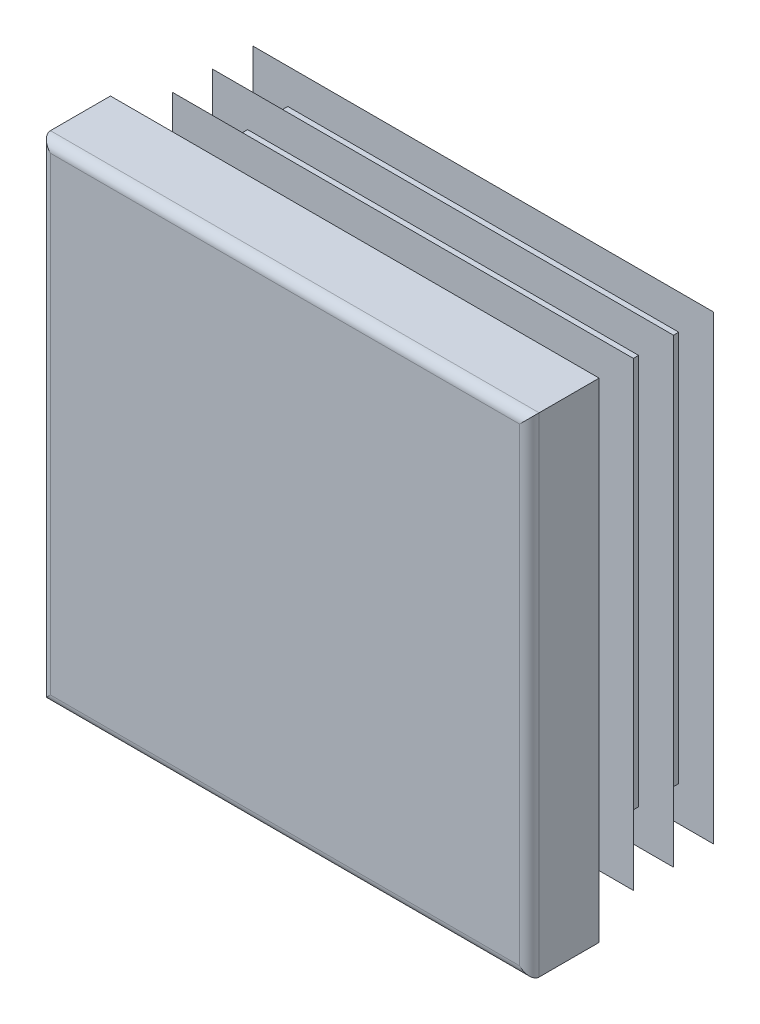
ISO-10303-21;
HEADER;
FILE_DESCRIPTION(('STEP AP214'),'2;1');
FILE_NAME('part.step','',(''),(''),'','','');
FILE_SCHEMA(('AUTOMOTIVE_DESIGN { 1 0 10303 214 1 1 1 1 }'));
ENDSEC;
DATA;
#1=APPLICATION_CONTEXT('core data for automotive mechanical design processes');
#2=APPLICATION_PROTOCOL_DEFINITION('international standard','automotive_design',2000,#1);
#3=PRODUCT_CONTEXT('',#1,'mechanical');
#4=PRODUCT('Part','Part','',(#3));
#5=PRODUCT_RELATED_PRODUCT_CATEGORY('part','',(#4));
#6=PRODUCT_DEFINITION_FORMATION('','',#4);
#7=PRODUCT_DEFINITION_CONTEXT('part definition',#1,'design');
#8=PRODUCT_DEFINITION('design','',#6,#7);
#9=PRODUCT_DEFINITION_SHAPE('','',#8);
#10=(LENGTH_UNIT() NAMED_UNIT(*) SI_UNIT(.MILLI.,.METRE.));
#11=(NAMED_UNIT(*) PLANE_ANGLE_UNIT() SI_UNIT($,.RADIAN.));
#12=(NAMED_UNIT(*) SI_UNIT($,.STERADIAN.) SOLID_ANGLE_UNIT());
#13=UNCERTAINTY_MEASURE_WITH_UNIT(LENGTH_MEASURE(1.E-05),#10,'distance_accuracy_value','');
#14=(GEOMETRIC_REPRESENTATION_CONTEXT(3) GLOBAL_UNCERTAINTY_ASSIGNED_CONTEXT((#13)) GLOBAL_UNIT_ASSIGNED_CONTEXT((#10,
#11,#12)) REPRESENTATION_CONTEXT('',''));
#15=CARTESIAN_POINT('',(0.,0.,0.));
#16=DIRECTION('',(0.,0.,1.));
#17=DIRECTION('',(1.,0.,0.));
#18=AXIS2_PLACEMENT_3D('',#15,#16,#17);
#19=CARTESIAN_POINT('',(16.8,-17.5,5.));
#20=DIRECTION('',(0.,0.,-1.));
#21=DIRECTION('',(0.,1.,0.));
#22=AXIS2_PLACEMENT_3D('',#19,#20,#21);
#23=PLANE('',#22);
#24=DIRECTION('',(0.,1.,0.));
#25=VECTOR('',#24,1.);
#26=CARTESIAN_POINT('',(-16.8,-17.5,5.));
#27=LINE('',#26,#25);
#28=CARTESIAN_POINT('',(-16.8,-16.8,5.));
#29=VERTEX_POINT('',#28);
#30=CARTESIAN_POINT('',(-16.8,16.8,5.));
#31=VERTEX_POINT('',#30);
#32=EDGE_CURVE('E262',#29,#31,#27,.T.);
#33=ORIENTED_EDGE('',*,*,#32,.F.);
#34=DIRECTION('',(-1.,0.,0.));
#35=VECTOR('',#34,1.);
#36=CARTESIAN_POINT('',(17.5,-16.8,5.));
#37=LINE('',#36,#35);
#38=CARTESIAN_POINT('',(16.8,-16.8,5.));
#39=VERTEX_POINT('',#38);
#40=EDGE_CURVE('E432',#39,#29,#37,.T.);
#41=ORIENTED_EDGE('',*,*,#40,.F.);
#42=DIRECTION('',(0.,1.,0.));
#43=VECTOR('',#42,1.);
#44=CARTESIAN_POINT('',(16.8,-17.5,5.));
#45=LINE('',#44,#43);
#46=CARTESIAN_POINT('',(16.8,16.8,5.));
#47=VERTEX_POINT('',#46);
#48=EDGE_CURVE('E257',#39,#47,#45,.T.);
#49=ORIENTED_EDGE('',*,*,#48,.T.);
#50=DIRECTION('',(-1.,0.,0.));
#51=VECTOR('',#50,1.);
#52=CARTESIAN_POINT('',(17.5,16.8,5.));
#53=LINE('',#52,#51);
#54=EDGE_CURVE('E534',#47,#31,#53,.T.);
#55=ORIENTED_EDGE('',*,*,#54,.T.);
#56=EDGE_LOOP('',(#33,#41,#49,#55));
#57=FACE_BOUND('',#56,.T.);
#58=ADVANCED_FACE('F14',(#57),#23,.F.);
#59=CARTESIAN_POINT('',(-16.8,-17.5,4.3));
#60=DIRECTION('',(0.,1.,0.));
#61=DIRECTION('',(-1.,0.,0.));
#62=AXIS2_PLACEMENT_3D('',#59,#60,#61);
#63=CYLINDRICAL_SURFACE('',#62,0.7);
#64=DIRECTION('',(0.,1.,0.));
#65=VECTOR('',#64,1.);
#66=CARTESIAN_POINT('',(-17.5,-17.5,4.3));
#67=LINE('',#66,#65);
#68=CARTESIAN_POINT('',(-17.5,-17.5,4.3));
#69=VERTEX_POINT('',#68);
#70=CARTESIAN_POINT('',(-17.5,17.5,4.3));
#71=VERTEX_POINT('',#70);
#72=EDGE_CURVE('E354',#69,#71,#67,.T.);
#73=ORIENTED_EDGE('',*,*,#72,.F.);
#74=CARTESIAN_POINT('',(-16.8,-16.8,4.3));
#75=DIRECTION('',(-0.707106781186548,0.707106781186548,0.));
#76=DIRECTION('',(0.707106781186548,0.707106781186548,0.));
#77=AXIS2_PLACEMENT_3D('',#74,#75,#76);
#78=ELLIPSE('',#77,0.989949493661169,0.7);
#79=EDGE_CURVE('E59',#69,#29,#78,.T.);
#80=ORIENTED_EDGE('',*,*,#79,.T.);
#81=ORIENTED_EDGE('',*,*,#32,.T.);
#82=CARTESIAN_POINT('',(-16.8,16.8,4.3));
#83=DIRECTION('',(0.707106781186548,0.707106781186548,0.));
#84=DIRECTION('',(-0.707106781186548,0.707106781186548,0.));
#85=AXIS2_PLACEMENT_3D('',#82,#83,#84);
#86=ELLIPSE('',#85,0.989949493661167,0.7);
#87=EDGE_CURVE('E258',#31,#71,#86,.F.);
#88=ORIENTED_EDGE('',*,*,#87,.T.);
#89=EDGE_LOOP('',(#73,#80,#81,#88));
#90=FACE_BOUND('',#89,.T.);
#91=ADVANCED_FACE('F16',(#90),#63,.T.);
#92=CARTESIAN_POINT('',(-17.5,-17.5,4.3));
#93=DIRECTION('',(1.,0.,0.));
#94=DIRECTION('',(0.,1.,0.));
#95=AXIS2_PLACEMENT_3D('',#92,#93,#94);
#96=PLANE('',#95);
#97=DIRECTION('',(0.,0.,-1.));
#98=VECTOR('',#97,1.);
#99=CARTESIAN_POINT('',(-17.5,17.5,4.3));
#100=LINE('',#99,#98);
#101=CARTESIAN_POINT('',(-17.5,17.5,0.));
#102=VERTEX_POINT('',#101);
#103=EDGE_CURVE('E519',#71,#102,#100,.T.);
#104=ORIENTED_EDGE('',*,*,#103,.T.);
#105=DIRECTION('',(0.,1.,0.));
#106=VECTOR('',#105,1.);
#107=CARTESIAN_POINT('',(-17.5,-17.5,0.));
#108=LINE('',#107,#106);
#109=CARTESIAN_POINT('',(-17.5,-17.5,0.));
#110=VERTEX_POINT('',#109);
#111=EDGE_CURVE('E352',#110,#102,#108,.T.);
#112=ORIENTED_EDGE('',*,*,#111,.F.);
#113=DIRECTION('',(0.,0.,-1.));
#114=VECTOR('',#113,1.);
#115=CARTESIAN_POINT('',(-17.5,-17.5,4.3));
#116=LINE('',#115,#114);
#117=EDGE_CURVE('E520',#69,#110,#116,.T.);
#118=ORIENTED_EDGE('',*,*,#117,.F.);
#119=ORIENTED_EDGE('',*,*,#72,.T.);
#120=EDGE_LOOP('',(#104,#112,#118,#119));
#121=FACE_BOUND('',#120,.T.);
#122=ADVANCED_FACE('F604',(#121),#96,.F.);
#123=CARTESIAN_POINT('',(-14.,-17.5,0.));
#124=DIRECTION('',(1.,0.,0.));
#125=DIRECTION('',(0.,1.,0.));
#126=AXIS2_PLACEMENT_3D('',#123,#124,#125);
#127=PLANE('',#126);
#128=DIRECTION('',(0.,1.,0.));
#129=VECTOR('',#128,1.);
#130=CARTESIAN_POINT('',(-14.,-17.5,0.));
#131=LINE('',#130,#129);
#132=CARTESIAN_POINT('',(-14.,-14.,0.));
#133=VERTEX_POINT('',#132);
#134=CARTESIAN_POINT('',(-14.,14.,0.));
#135=VERTEX_POINT('',#134);
#136=EDGE_CURVE('E349',#133,#135,#131,.T.);
#137=ORIENTED_EDGE('',*,*,#136,.T.);
#138=DIRECTION('',(0.,0.,-1.));
#139=VECTOR('',#138,1.);
#140=CARTESIAN_POINT('',(-14.,14.,0.));
#141=LINE('',#140,#139);
#142=CARTESIAN_POINT('',(-14.,14.,-0.575));
#143=VERTEX_POINT('',#142);
#144=EDGE_CURVE('E445',#135,#143,#141,.T.);
#145=ORIENTED_EDGE('',*,*,#144,.T.);
#146=DIRECTION('',(0.,1.,0.));
#147=VECTOR('',#146,1.);
#148=CARTESIAN_POINT('',(-14.,-17.5,-0.575));
#149=LINE('',#148,#147);
#150=CARTESIAN_POINT('',(-14.,-14.,-0.575));
#151=VERTEX_POINT('',#150);
#152=EDGE_CURVE('E346',#151,#143,#149,.T.);
#153=ORIENTED_EDGE('',*,*,#152,.F.);
#154=DIRECTION('',(0.,0.,1.));
#155=VECTOR('',#154,1.);
#156=CARTESIAN_POINT('',(-14.,-14.,0.));
#157=LINE('',#156,#155);
#158=EDGE_CURVE('E439',#151,#133,#157,.T.);
#159=ORIENTED_EDGE('',*,*,#158,.T.);
#160=EDGE_LOOP('',(#137,#145,#153,#159));
#161=FACE_BOUND('',#160,.T.);
#162=ADVANCED_FACE('F728',(#161),#127,.F.);
#163=CARTESIAN_POINT('',(-16.5,-17.5,-0.575));
#164=DIRECTION('',(0.573576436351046,0.,0.819152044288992));
#165=DIRECTION('',(-0.819152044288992,0.,0.573576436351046));
#166=AXIS2_PLACEMENT_3D('',#163,#164,#165);
#167=PLANE('',#166);
#168=DIRECTION('',(0.,1.,0.));
#169=VECTOR('',#168,1.);
#170=CARTESIAN_POINT('',(-16.5,-17.5,-0.575));
#171=LINE('',#170,#169);
#172=CARTESIAN_POINT('',(-16.5,-16.5,-0.575));
#173=VERTEX_POINT('',#172);
#174=CARTESIAN_POINT('',(-16.5,16.5,-0.575));
#175=VERTEX_POINT('',#174);
#176=EDGE_CURVE('E344',#173,#175,#171,.T.);
#177=ORIENTED_EDGE('',*,*,#176,.T.);
#178=DIRECTION('',(0.633687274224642,-0.633687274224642,-0.443712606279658));
#179=VECTOR('',#178,1.);
#180=CARTESIAN_POINT('',(-2.84697490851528,2.84697490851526,-10.1349510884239));
#181=LINE('',#180,#179);
#182=CARTESIAN_POINT('',(-14.,14.,-2.32551884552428));
#183=VERTEX_POINT('',#182);
#184=EDGE_CURVE('E457',#175,#183,#181,.T.);
#185=ORIENTED_EDGE('',*,*,#184,.T.);
#186=DIRECTION('',(0.,1.,0.));
#187=VECTOR('',#186,1.);
#188=CARTESIAN_POINT('',(-14.,-17.5,-2.32551884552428));
#189=LINE('',#188,#187);
#190=CARTESIAN_POINT('',(-14.,-14.,-2.32551884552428));
#191=VERTEX_POINT('',#190);
#192=EDGE_CURVE('E341',#191,#183,#189,.T.);
#193=ORIENTED_EDGE('',*,*,#192,.F.);
#194=DIRECTION('',(-0.633687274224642,-0.633687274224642,0.443712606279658));
#195=VECTOR('',#194,1.);
#196=CARTESIAN_POINT('',(-16.9015595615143,-16.9015595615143,-0.293824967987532));
#197=LINE('',#196,#195);
#198=EDGE_CURVE('E451',#191,#173,#197,.T.);
#199=ORIENTED_EDGE('',*,*,#198,.T.);
#200=EDGE_LOOP('',(#177,#185,#193,#199));
#201=FACE_BOUND('',#200,.T.);
#202=ADVANCED_FACE('F732',(#201),#167,.F.);
#203=CARTESIAN_POINT('',(-14.,-17.5,-2.32551884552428));
#204=DIRECTION('',(1.,0.,0.));
#205=DIRECTION('',(0.,1.,0.));
#206=AXIS2_PLACEMENT_3D('',#203,#204,#205);
#207=PLANE('',#206);
#208=ORIENTED_EDGE('',*,*,#192,.T.);
#209=DIRECTION('',(0.,0.,-1.));
#210=VECTOR('',#209,1.);
#211=CARTESIAN_POINT('',(-14.,14.,-2.32551884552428));
#212=LINE('',#211,#210);
#213=CARTESIAN_POINT('',(-14.,14.,-3.45));
#214=VERTEX_POINT('',#213);
#215=EDGE_CURVE('E463',#183,#214,#212,.T.);
#216=ORIENTED_EDGE('',*,*,#215,.T.);
#217=DIRECTION('',(0.,1.,0.));
#218=VECTOR('',#217,1.);
#219=CARTESIAN_POINT('',(-14.,-17.5,-3.45));
#220=LINE('',#219,#218);
#221=CARTESIAN_POINT('',(-14.,-14.,-3.45));
#222=VERTEX_POINT('',#221);
#223=EDGE_CURVE('E338',#222,#214,#220,.T.);
#224=ORIENTED_EDGE('',*,*,#223,.F.);
#225=DIRECTION('',(0.,0.,1.));
#226=VECTOR('',#225,1.);
#227=CARTESIAN_POINT('',(-14.,-14.,-2.32551884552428));
#228=LINE('',#227,#226);
#229=EDGE_CURVE('E460',#222,#191,#228,.T.);
#230=ORIENTED_EDGE('',*,*,#229,.T.);
#231=EDGE_LOOP('',(#208,#216,#224,#230));
#232=FACE_BOUND('',#231,.T.);
#233=ADVANCED_FACE('F738',(#232),#207,.F.);
#234=CARTESIAN_POINT('',(-16.5,-17.5,-3.45));
#235=DIRECTION('',(0.573576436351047,0.,0.819152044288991));
#236=DIRECTION('',(-0.819152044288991,0.,0.573576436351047));
#237=AXIS2_PLACEMENT_3D('',#234,#235,#236);
#238=PLANE('',#237);
#239=DIRECTION('',(0.,1.,0.));
#240=VECTOR('',#239,1.);
#241=CARTESIAN_POINT('',(-16.5,-17.5,-3.45));
#242=LINE('',#241,#240);
#243=CARTESIAN_POINT('',(-16.5,-16.5,-3.45));
#244=VERTEX_POINT('',#243);
#245=CARTESIAN_POINT('',(-16.5,16.5,-3.45));
#246=VERTEX_POINT('',#245);
#247=EDGE_CURVE('E336',#244,#246,#242,.T.);
#248=ORIENTED_EDGE('',*,*,#247,.T.);
#249=DIRECTION('',(0.633687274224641,-0.633687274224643,-0.443712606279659));
#250=VECTOR('',#249,1.);
#251=CARTESIAN_POINT('',(-2.84697490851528,2.84697490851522,-13.0099510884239));
#252=LINE('',#251,#250);
#253=CARTESIAN_POINT('',(-14.,14.,-5.20051884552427));
#254=VERTEX_POINT('',#253);
#255=EDGE_CURVE('E475',#246,#254,#252,.T.);
#256=ORIENTED_EDGE('',*,*,#255,.T.);
#257=DIRECTION('',(0.,1.,0.));
#258=VECTOR('',#257,1.);
#259=CARTESIAN_POINT('',(-14.,-17.5,-5.20051884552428));
#260=LINE('',#259,#258);
#261=CARTESIAN_POINT('',(-14.,-14.,-5.20051884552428));
#262=VERTEX_POINT('',#261);
#263=EDGE_CURVE('E333',#262,#254,#260,.T.);
#264=ORIENTED_EDGE('',*,*,#263,.F.);
#265=DIRECTION('',(-0.633687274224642,-0.633687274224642,0.443712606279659));
#266=VECTOR('',#265,1.);
#267=CARTESIAN_POINT('',(-16.9015595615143,-16.9015595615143,-3.16882496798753));
#268=LINE('',#267,#266);
#269=EDGE_CURVE('E469',#262,#244,#268,.T.);
#270=ORIENTED_EDGE('',*,*,#269,.T.);
#271=EDGE_LOOP('',(#248,#256,#264,#270));
#272=FACE_BOUND('',#271,.T.);
#273=ADVANCED_FACE('F742',(#272),#238,.F.);
#274=CARTESIAN_POINT('',(-14.,-17.5,-5.20051884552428));
#275=DIRECTION('',(1.,0.,0.));
#276=DIRECTION('',(0.,1.,0.));
#277=AXIS2_PLACEMENT_3D('',#274,#275,#276);
#278=PLANE('',#277);
#279=ORIENTED_EDGE('',*,*,#263,.T.);
#280=DIRECTION('',(0.,0.,-1.));
#281=VECTOR('',#280,1.);
#282=CARTESIAN_POINT('',(-14.,14.,-5.20051884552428));
#283=LINE('',#282,#281);
#284=CARTESIAN_POINT('',(-14.,14.,-6.325));
#285=VERTEX_POINT('',#284);
#286=EDGE_CURVE('E481',#254,#285,#283,.T.);
#287=ORIENTED_EDGE('',*,*,#286,.T.);
#288=DIRECTION('',(0.,1.,0.));
#289=VECTOR('',#288,1.);
#290=CARTESIAN_POINT('',(-14.,-17.5,-6.325));
#291=LINE('',#290,#289);
#292=CARTESIAN_POINT('',(-14.,-14.,-6.325));
#293=VERTEX_POINT('',#292);
#294=EDGE_CURVE('E330',#293,#285,#291,.T.);
#295=ORIENTED_EDGE('',*,*,#294,.F.);
#296=DIRECTION('',(0.,0.,1.));
#297=VECTOR('',#296,1.);
#298=CARTESIAN_POINT('',(-14.,-14.,-5.20051884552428));
#299=LINE('',#298,#297);
#300=EDGE_CURVE('E478',#293,#262,#299,.T.);
#301=ORIENTED_EDGE('',*,*,#300,.T.);
#302=EDGE_LOOP('',(#279,#287,#295,#301));
#303=FACE_BOUND('',#302,.T.);
#304=ADVANCED_FACE('F746',(#303),#278,.F.);
#305=CARTESIAN_POINT('',(-16.5,-17.5,-6.325));
#306=DIRECTION('',(0.573576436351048,0.,0.819152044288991));
#307=DIRECTION('',(-0.819152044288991,0.,0.573576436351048));
#308=AXIS2_PLACEMENT_3D('',#305,#306,#307);
#309=PLANE('',#308);
#310=DIRECTION('',(0.,1.,0.));
#311=VECTOR('',#310,1.);
#312=CARTESIAN_POINT('',(-16.5,-17.5,-6.325));
#313=LINE('',#312,#311);
#314=CARTESIAN_POINT('',(-16.5,-16.5,-6.325));
#315=VERTEX_POINT('',#314);
#316=CARTESIAN_POINT('',(-16.5,16.5,-6.325));
#317=VERTEX_POINT('',#316);
#318=EDGE_CURVE('E328',#315,#317,#313,.T.);
#319=ORIENTED_EDGE('',*,*,#318,.T.);
#320=DIRECTION('',(0.633687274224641,-0.633687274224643,-0.443712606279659));
#321=VECTOR('',#320,1.);
#322=CARTESIAN_POINT('',(-2.84697490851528,2.84697490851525,-15.8849510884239));
#323=LINE('',#322,#321);
#324=CARTESIAN_POINT('',(-14.,14.,-8.07551884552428));
#325=VERTEX_POINT('',#324);
#326=EDGE_CURVE('E493',#317,#325,#323,.T.);
#327=ORIENTED_EDGE('',*,*,#326,.T.);
#328=DIRECTION('',(0.,1.,0.));
#329=VECTOR('',#328,1.);
#330=CARTESIAN_POINT('',(-14.,-17.5,-8.07551884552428));
#331=LINE('',#330,#329);
#332=CARTESIAN_POINT('',(-14.,-14.,-8.07551884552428));
#333=VERTEX_POINT('',#332);
#334=EDGE_CURVE('E325',#333,#325,#331,.T.);
#335=ORIENTED_EDGE('',*,*,#334,.F.);
#336=DIRECTION('',(-0.633687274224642,-0.633687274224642,0.443712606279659));
#337=VECTOR('',#336,1.);
#338=CARTESIAN_POINT('',(-16.9015595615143,-16.9015595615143,-6.04382496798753));
#339=LINE('',#338,#337);
#340=EDGE_CURVE('E487',#333,#315,#339,.T.);
#341=ORIENTED_EDGE('',*,*,#340,.T.);
#342=EDGE_LOOP('',(#319,#327,#335,#341));
#343=FACE_BOUND('',#342,.T.);
#344=ADVANCED_FACE('F668',(#343),#309,.F.);
#345=CARTESIAN_POINT('',(-14.,-17.5,-8.07551884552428));
#346=DIRECTION('',(1.,0.,0.));
#347=DIRECTION('',(0.,1.,0.));
#348=AXIS2_PLACEMENT_3D('',#345,#346,#347);
#349=PLANE('',#348);
#350=ORIENTED_EDGE('',*,*,#334,.T.);
#351=DIRECTION('',(0.,0.,-1.));
#352=VECTOR('',#351,1.);
#353=CARTESIAN_POINT('',(-14.,14.,-8.07551884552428));
#354=LINE('',#353,#352);
#355=CARTESIAN_POINT('',(-14.,14.,-9.2));
#356=VERTEX_POINT('',#355);
#357=EDGE_CURVE('E499',#325,#356,#354,.T.);
#358=ORIENTED_EDGE('',*,*,#357,.T.);
#359=DIRECTION('',(0.,1.,0.));
#360=VECTOR('',#359,1.);
#361=CARTESIAN_POINT('',(-14.,-17.5,-9.2));
#362=LINE('',#361,#360);
#363=CARTESIAN_POINT('',(-14.,-14.,-9.2));
#364=VERTEX_POINT('',#363);
#365=EDGE_CURVE('E322',#364,#356,#362,.T.);
#366=ORIENTED_EDGE('',*,*,#365,.F.);
#367=DIRECTION('',(0.,0.,1.));
#368=VECTOR('',#367,1.);
#369=CARTESIAN_POINT('',(-14.,-14.,-8.07551884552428));
#370=LINE('',#369,#368);
#371=EDGE_CURVE('E496',#364,#333,#370,.T.);
#372=ORIENTED_EDGE('',*,*,#371,.T.);
#373=EDGE_LOOP('',(#350,#358,#366,#372));
#374=FACE_BOUND('',#373,.T.);
#375=ADVANCED_FACE('F665',(#374),#349,.F.);
#376=CARTESIAN_POINT('',(-16.5,-17.5,-9.2));
#377=DIRECTION('',(0.573576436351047,0.,0.819152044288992));
#378=DIRECTION('',(-0.819152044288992,0.,0.573576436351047));
#379=AXIS2_PLACEMENT_3D('',#376,#377,#378);
#380=PLANE('',#379);
#381=DIRECTION('',(0.,1.,0.));
#382=VECTOR('',#381,1.);
#383=CARTESIAN_POINT('',(-16.5,-17.5,-9.2));
#384=LINE('',#383,#382);
#385=CARTESIAN_POINT('',(-16.5,-16.5,-9.2));
#386=VERTEX_POINT('',#385);
#387=CARTESIAN_POINT('',(-16.5,16.5,-9.2));
#388=VERTEX_POINT('',#387);
#389=EDGE_CURVE('E320',#386,#388,#384,.T.);
#390=ORIENTED_EDGE('',*,*,#389,.T.);
#391=DIRECTION('',(0.633687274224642,-0.633687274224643,-0.443712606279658));
#392=VECTOR('',#391,1.);
#393=CARTESIAN_POINT('',(-2.84697490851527,2.84697490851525,-18.7599510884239));
#394=LINE('',#393,#392);
#395=CARTESIAN_POINT('',(-14.,14.,-10.9505188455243));
#396=VERTEX_POINT('',#395);
#397=EDGE_CURVE('E511',#388,#396,#394,.T.);
#398=ORIENTED_EDGE('',*,*,#397,.T.);
#399=DIRECTION('',(0.,1.,0.));
#400=VECTOR('',#399,1.);
#401=CARTESIAN_POINT('',(-14.,-17.5,-10.9505188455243));
#402=LINE('',#401,#400);
#403=CARTESIAN_POINT('',(-14.,-14.,-10.9505188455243));
#404=VERTEX_POINT('',#403);
#405=EDGE_CURVE('E317',#404,#396,#402,.T.);
#406=ORIENTED_EDGE('',*,*,#405,.F.);
#407=DIRECTION('',(-0.633687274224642,-0.633687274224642,0.443712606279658));
#408=VECTOR('',#407,1.);
#409=CARTESIAN_POINT('',(-16.9015595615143,-16.9015595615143,-8.91882496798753));
#410=LINE('',#409,#408);
#411=EDGE_CURVE('E505',#404,#386,#410,.T.);
#412=ORIENTED_EDGE('',*,*,#411,.T.);
#413=EDGE_LOOP('',(#390,#398,#406,#412));
#414=FACE_BOUND('',#413,.T.);
#415=ADVANCED_FACE('F580',(#414),#380,.F.);
#416=CARTESIAN_POINT('',(-14.,-17.5,-10.9505188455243));
#417=DIRECTION('',(1.,0.,0.));
#418=DIRECTION('',(0.,1.,0.));
#419=AXIS2_PLACEMENT_3D('',#416,#417,#418);
#420=PLANE('',#419);
#421=ORIENTED_EDGE('',*,*,#405,.T.);
#422=DIRECTION('',(0.,0.,-1.));
#423=VECTOR('',#422,1.);
#424=CARTESIAN_POINT('',(-14.,14.,-10.9505188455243));
#425=LINE('',#424,#423);
#426=CARTESIAN_POINT('',(-14.,14.,-11.5));
#427=VERTEX_POINT('',#426);
#428=EDGE_CURVE('E517',#396,#427,#425,.T.);
#429=ORIENTED_EDGE('',*,*,#428,.T.);
#430=DIRECTION('',(0.,1.,0.));
#431=VECTOR('',#430,1.);
#432=CARTESIAN_POINT('',(-14.,-17.5,-11.5));
#433=LINE('',#432,#431);
#434=CARTESIAN_POINT('',(-14.,-14.,-11.5));
#435=VERTEX_POINT('',#434);
#436=EDGE_CURVE('E314',#435,#427,#433,.T.);
#437=ORIENTED_EDGE('',*,*,#436,.F.);
#438=DIRECTION('',(0.,0.,1.));
#439=VECTOR('',#438,1.);
#440=CARTESIAN_POINT('',(-14.,-14.,-10.9505188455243));
#441=LINE('',#440,#439);
#442=EDGE_CURVE('E514',#435,#404,#441,.T.);
#443=ORIENTED_EDGE('',*,*,#442,.T.);
#444=EDGE_LOOP('',(#421,#429,#437,#443));
#445=FACE_BOUND('',#444,.T.);
#446=ADVANCED_FACE('F582',(#445),#420,.F.);
#447=CARTESIAN_POINT('',(-14.,-17.5,-11.5));
#448=DIRECTION('',(0.,0.,1.));
#449=DIRECTION('',(0.,-1.,0.));
#450=AXIS2_PLACEMENT_3D('',#447,#448,#449);
#451=PLANE('',#450);
#452=ORIENTED_EDGE('',*,*,#436,.T.);
#453=DIRECTION('',(-1.,0.,0.));
#454=VECTOR('',#453,1.);
#455=CARTESIAN_POINT('',(17.5,14.,-11.5));
#456=LINE('',#455,#454);
#457=CARTESIAN_POINT('',(14.,14.,-11.5));
#458=VERTEX_POINT('',#457);
#459=EDGE_CURVE('E388',#458,#427,#456,.T.);
#460=ORIENTED_EDGE('',*,*,#459,.F.);
#461=DIRECTION('',(0.,1.,0.));
#462=VECTOR('',#461,1.);
#463=CARTESIAN_POINT('',(14.,-17.5,-11.5));
#464=LINE('',#463,#462);
#465=CARTESIAN_POINT('',(14.,-14.,-11.5));
#466=VERTEX_POINT('',#465);
#467=EDGE_CURVE('E311',#466,#458,#464,.T.);
#468=ORIENTED_EDGE('',*,*,#467,.F.);
#469=DIRECTION('',(-1.,0.,0.));
#470=VECTOR('',#469,1.);
#471=CARTESIAN_POINT('',(17.5,-14.,-11.5));
#472=LINE('',#471,#470);
#473=EDGE_CURVE('E386',#466,#435,#472,.T.);
#474=ORIENTED_EDGE('',*,*,#473,.T.);
#475=EDGE_LOOP('',(#452,#460,#468,#474));
#476=FACE_BOUND('',#475,.T.);
#477=ADVANCED_FACE('F385',(#476),#451,.F.);
#478=CARTESIAN_POINT('',(14.,-17.5,-11.5));
#479=DIRECTION('',(-1.,0.,0.));
#480=DIRECTION('',(0.,-1.,0.));
#481=AXIS2_PLACEMENT_3D('',#478,#479,#480);
#482=PLANE('',#481);
#483=ORIENTED_EDGE('',*,*,#467,.T.);
#484=DIRECTION('',(0.,0.,1.));
#485=VECTOR('',#484,1.);
#486=CARTESIAN_POINT('',(14.,14.,-11.5));
#487=LINE('',#486,#485);
#488=CARTESIAN_POINT('',(14.,14.,-10.9505188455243));
#489=VERTEX_POINT('',#488);
#490=EDGE_CURVE('E9',#458,#489,#487,.T.);
#491=ORIENTED_EDGE('',*,*,#490,.T.);
#492=DIRECTION('',(0.,1.,0.));
#493=VECTOR('',#492,1.);
#494=CARTESIAN_POINT('',(14.,-17.5,-10.9505188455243));
#495=LINE('',#494,#493);
#496=CARTESIAN_POINT('',(14.,-14.,-10.9505188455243));
#497=VERTEX_POINT('',#496);
#498=EDGE_CURVE('E308',#497,#489,#495,.T.);
#499=ORIENTED_EDGE('',*,*,#498,.F.);
#500=DIRECTION('',(0.,0.,-1.));
#501=VECTOR('',#500,1.);
#502=CARTESIAN_POINT('',(14.,-14.,-11.5));
#503=LINE('',#502,#501);
#504=EDGE_CURVE('E23',#497,#466,#503,.T.);
#505=ORIENTED_EDGE('',*,*,#504,.T.);
#506=EDGE_LOOP('',(#483,#491,#499,#505));
#507=FACE_BOUND('',#506,.T.);
#508=ADVANCED_FACE('F378',(#507),#482,.F.);
#509=CARTESIAN_POINT('',(14.,-17.5,-10.9505188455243));
#510=DIRECTION('',(-0.573576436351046,0.,0.819152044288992));
#511=DIRECTION('',(-0.819152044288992,0.,-0.573576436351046));
#512=AXIS2_PLACEMENT_3D('',#509,#510,#511);
#513=PLANE('',#512);
#514=ORIENTED_EDGE('',*,*,#498,.T.);
#515=DIRECTION('',(0.633687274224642,0.633687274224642,0.443712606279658));
#516=VECTOR('',#515,1.);
#517=CARTESIAN_POINT('',(1.35087381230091,1.35087381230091,-19.807532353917));
#518=LINE('',#517,#516);
#519=CARTESIAN_POINT('',(16.5,16.5,-9.2));
#520=VERTEX_POINT('',#519);
#521=EDGE_CURVE('E508',#489,#520,#518,.T.);
#522=ORIENTED_EDGE('',*,*,#521,.T.);
#523=DIRECTION('',(0.,1.,0.));
#524=VECTOR('',#523,1.);
#525=CARTESIAN_POINT('',(16.5,-17.5,-9.2));
#526=LINE('',#525,#524);
#527=CARTESIAN_POINT('',(16.5,-16.5,-9.2));
#528=VERTEX_POINT('',#527);
#529=EDGE_CURVE('E305',#528,#520,#526,.T.);
#530=ORIENTED_EDGE('',*,*,#529,.F.);
#531=DIRECTION('',(-0.633687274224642,0.633687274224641,-0.443712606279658));
#532=VECTOR('',#531,1.);
#533=CARTESIAN_POINT('',(15.4054584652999,-15.4054584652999,-9.96640623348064));
#534=LINE('',#533,#532);
#535=EDGE_CURVE('E502',#528,#497,#534,.T.);
#536=ORIENTED_EDGE('',*,*,#535,.T.);
#537=EDGE_LOOP('',(#514,#522,#530,#536));
#538=FACE_BOUND('',#537,.T.);
#539=ADVANCED_FACE('F588',(#538),#513,.F.);
#540=CARTESIAN_POINT('',(16.5,-17.5,-9.2));
#541=DIRECTION('',(0.,0.,-1.));
#542=DIRECTION('',(0.,1.,0.));
#543=AXIS2_PLACEMENT_3D('',#540,#541,#542);
#544=PLANE('',#543);
#545=ORIENTED_EDGE('',*,*,#529,.T.);
#546=DIRECTION('',(-1.,0.,0.));
#547=VECTOR('',#546,1.);
#548=CARTESIAN_POINT('',(17.5,16.5,-9.2));
#549=LINE('',#548,#547);
#550=EDGE_CURVE('E394',#520,#388,#549,.T.);
#551=ORIENTED_EDGE('',*,*,#550,.T.);
#552=ORIENTED_EDGE('',*,*,#389,.F.);
#553=DIRECTION('',(-1.,0.,0.));
#554=VECTOR('',#553,1.);
#555=CARTESIAN_POINT('',(17.5,-16.5,-9.2));
#556=LINE('',#555,#554);
#557=EDGE_CURVE('E401',#528,#386,#556,.T.);
#558=ORIENTED_EDGE('',*,*,#557,.F.);
#559=EDGE_LOOP('',(#545,#551,#552,#558));
#560=FACE_BOUND('',#559,.T.);
#561=ORIENTED_EDGE('',*,*,#365,.T.);
#562=DIRECTION('',(-1.,0.,0.));
#563=VECTOR('',#562,1.);
#564=CARTESIAN_POINT('',(17.5,14.,-9.2));
#565=LINE('',#564,#563);
#566=CARTESIAN_POINT('',(14.,14.,-9.2));
#567=VERTEX_POINT('',#566);
#568=EDGE_CURVE('E567',#567,#356,#565,.T.);
#569=ORIENTED_EDGE('',*,*,#568,.F.);
#570=DIRECTION('',(0.,1.,0.));
#571=VECTOR('',#570,1.);
#572=CARTESIAN_POINT('',(14.,-17.5,-9.2));
#573=LINE('',#572,#571);
#574=CARTESIAN_POINT('',(14.,-14.,-9.2));
#575=VERTEX_POINT('',#574);
#576=EDGE_CURVE('E302',#575,#567,#573,.T.);
#577=ORIENTED_EDGE('',*,*,#576,.F.);
#578=DIRECTION('',(-1.,0.,0.));
#579=VECTOR('',#578,1.);
#580=CARTESIAN_POINT('',(17.5,-14.,-9.2));
#581=LINE('',#580,#579);
#582=EDGE_CURVE('E403',#575,#364,#581,.T.);
#583=ORIENTED_EDGE('',*,*,#582,.T.);
#584=EDGE_LOOP('',(#561,#569,#577,#583));
#585=FACE_BOUND('',#584,.T.);
#586=ADVANCED_FACE('F571',(#560,#585),#544,.F.);
#587=CARTESIAN_POINT('',(14.,-17.5,-9.2));
#588=DIRECTION('',(-1.,0.,0.));
#589=DIRECTION('',(0.,-1.,0.));
#590=AXIS2_PLACEMENT_3D('',#587,#588,#589);
#591=PLANE('',#590);
#592=ORIENTED_EDGE('',*,*,#576,.T.);
#593=DIRECTION('',(0.,0.,1.));
#594=VECTOR('',#593,1.);
#595=CARTESIAN_POINT('',(14.,14.,-9.2));
#596=LINE('',#595,#594);
#597=CARTESIAN_POINT('',(14.,14.,-8.07551884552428));
#598=VERTEX_POINT('',#597);
#599=EDGE_CURVE('E372',#567,#598,#596,.T.);
#600=ORIENTED_EDGE('',*,*,#599,.T.);
#601=DIRECTION('',(0.,1.,0.));
#602=VECTOR('',#601,1.);
#603=CARTESIAN_POINT('',(14.,-17.5,-8.07551884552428));
#604=LINE('',#603,#602);
#605=CARTESIAN_POINT('',(14.,-14.,-8.07551884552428));
#606=VERTEX_POINT('',#605);
#607=EDGE_CURVE('E299',#606,#598,#604,.T.);
#608=ORIENTED_EDGE('',*,*,#607,.F.);
#609=DIRECTION('',(0.,0.,-1.));
#610=VECTOR('',#609,1.);
#611=CARTESIAN_POINT('',(14.,-14.,-9.2));
#612=LINE('',#611,#610);
#613=EDGE_CURVE('E369',#606,#575,#612,.T.);
#614=ORIENTED_EDGE('',*,*,#613,.T.);
#615=EDGE_LOOP('',(#592,#600,#608,#614));
#616=FACE_BOUND('',#615,.T.);
#617=ADVANCED_FACE('F596',(#616),#591,.F.);
#618=CARTESIAN_POINT('',(14.,-17.5,-8.07551884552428));
#619=DIRECTION('',(-0.573576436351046,0.,0.819152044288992));
#620=DIRECTION('',(-0.819152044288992,0.,-0.573576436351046));
#621=AXIS2_PLACEMENT_3D('',#618,#619,#620);
#622=PLANE('',#621);
#623=ORIENTED_EDGE('',*,*,#607,.T.);
#624=DIRECTION('',(0.633687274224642,0.633687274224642,0.443712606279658));
#625=VECTOR('',#624,1.);
#626=CARTESIAN_POINT('',(1.35087381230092,1.35087381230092,-16.9325323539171));
#627=LINE('',#626,#625);
#628=CARTESIAN_POINT('',(16.5,16.5,-6.325));
#629=VERTEX_POINT('',#628);
#630=EDGE_CURVE('E490',#598,#629,#627,.T.);
#631=ORIENTED_EDGE('',*,*,#630,.T.);
#632=DIRECTION('',(0.,1.,0.));
#633=VECTOR('',#632,1.);
#634=CARTESIAN_POINT('',(16.5,-17.5,-6.325));
#635=LINE('',#634,#633);
#636=CARTESIAN_POINT('',(16.5,-16.5,-6.325));
#637=VERTEX_POINT('',#636);
#638=EDGE_CURVE('E296',#637,#629,#635,.T.);
#639=ORIENTED_EDGE('',*,*,#638,.F.);
#640=DIRECTION('',(-0.633687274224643,0.633687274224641,-0.443712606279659));
#641=VECTOR('',#640,1.);
#642=CARTESIAN_POINT('',(15.4054584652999,-15.4054584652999,-7.09140623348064));
#643=LINE('',#642,#641);
#644=EDGE_CURVE('E484',#637,#606,#643,.T.);
#645=ORIENTED_EDGE('',*,*,#644,.T.);
#646=EDGE_LOOP('',(#623,#631,#639,#645));
#647=FACE_BOUND('',#646,.T.);
#648=ADVANCED_FACE('F648',(#647),#622,.F.);
#649=CARTESIAN_POINT('',(16.5,-17.5,-6.325));
#650=DIRECTION('',(0.,0.,-1.));
#651=DIRECTION('',(0.,1.,0.));
#652=AXIS2_PLACEMENT_3D('',#649,#650,#651);
#653=PLANE('',#652);
#654=ORIENTED_EDGE('',*,*,#638,.T.);
#655=DIRECTION('',(-1.,0.,0.));
#656=VECTOR('',#655,1.);
#657=CARTESIAN_POINT('',(17.5,16.5,-6.325));
#658=LINE('',#657,#656);
#659=EDGE_CURVE('E561',#629,#317,#658,.T.);
#660=ORIENTED_EDGE('',*,*,#659,.T.);
#661=ORIENTED_EDGE('',*,*,#318,.F.);
#662=DIRECTION('',(-1.,0.,0.));
#663=VECTOR('',#662,1.);
#664=CARTESIAN_POINT('',(17.5,-16.5,-6.325));
#665=LINE('',#664,#663);
#666=EDGE_CURVE('E409',#637,#315,#665,.T.);
#667=ORIENTED_EDGE('',*,*,#666,.F.);
#668=EDGE_LOOP('',(#654,#660,#661,#667));
#669=FACE_BOUND('',#668,.T.);
#670=ORIENTED_EDGE('',*,*,#294,.T.);
#671=DIRECTION('',(-1.,0.,0.));
#672=VECTOR('',#671,1.);
#673=CARTESIAN_POINT('',(17.5,14.,-6.325));
#674=LINE('',#673,#672);
#675=CARTESIAN_POINT('',(14.,14.,-6.325));
#676=VERTEX_POINT('',#675);
#677=EDGE_CURVE('E559',#676,#285,#674,.T.);
#678=ORIENTED_EDGE('',*,*,#677,.F.);
#679=DIRECTION('',(0.,1.,0.));
#680=VECTOR('',#679,1.);
#681=CARTESIAN_POINT('',(14.,-17.5,-6.325));
#682=LINE('',#681,#680);
#683=CARTESIAN_POINT('',(14.,-14.,-6.325));
#684=VERTEX_POINT('',#683);
#685=EDGE_CURVE('E293',#684,#676,#682,.T.);
#686=ORIENTED_EDGE('',*,*,#685,.F.);
#687=DIRECTION('',(-1.,0.,0.));
#688=VECTOR('',#687,1.);
#689=CARTESIAN_POINT('',(17.5,-14.,-6.325));
#690=LINE('',#689,#688);
#691=EDGE_CURVE('E411',#684,#293,#690,.T.);
#692=ORIENTED_EDGE('',*,*,#691,.T.);
#693=EDGE_LOOP('',(#670,#678,#686,#692));
#694=FACE_BOUND('',#693,.T.);
#695=ADVANCED_FACE('F644',(#669,#694),#653,.F.);
#696=CARTESIAN_POINT('',(14.,-17.5,-6.325));
#697=DIRECTION('',(-1.,0.,0.));
#698=DIRECTION('',(0.,-1.,0.));
#699=AXIS2_PLACEMENT_3D('',#696,#697,#698);
#700=PLANE('',#699);
#701=ORIENTED_EDGE('',*,*,#685,.T.);
#702=DIRECTION('',(0.,0.,1.));
#703=VECTOR('',#702,1.);
#704=CARTESIAN_POINT('',(14.,14.,-6.325));
#705=LINE('',#704,#703);
#706=CARTESIAN_POINT('',(14.,14.,-5.20051884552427));
#707=VERTEX_POINT('',#706);
#708=EDGE_CURVE('E366',#676,#707,#705,.T.);
#709=ORIENTED_EDGE('',*,*,#708,.T.);
#710=DIRECTION('',(0.,1.,0.));
#711=VECTOR('',#710,1.);
#712=CARTESIAN_POINT('',(14.,-17.5,-5.20051884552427));
#713=LINE('',#712,#711);
#714=CARTESIAN_POINT('',(14.,-14.,-5.20051884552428));
#715=VERTEX_POINT('',#714);
#716=EDGE_CURVE('E290',#715,#707,#713,.T.);
#717=ORIENTED_EDGE('',*,*,#716,.F.);
#718=DIRECTION('',(0.,0.,-1.));
#719=VECTOR('',#718,1.);
#720=CARTESIAN_POINT('',(14.,-14.,-6.325));
#721=LINE('',#720,#719);
#722=EDGE_CURVE('E363',#715,#684,#721,.T.);
#723=ORIENTED_EDGE('',*,*,#722,.T.);
#724=EDGE_LOOP('',(#701,#709,#717,#723));
#725=FACE_BOUND('',#724,.T.);
#726=ADVANCED_FACE('F640',(#725),#700,.F.);
#727=CARTESIAN_POINT('',(14.,-17.5,-5.20051884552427));
#728=DIRECTION('',(-0.573576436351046,0.,0.819152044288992));
#729=DIRECTION('',(-0.819152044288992,0.,-0.573576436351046));
#730=AXIS2_PLACEMENT_3D('',#727,#728,#729);
#731=PLANE('',#730);
#732=ORIENTED_EDGE('',*,*,#716,.T.);
#733=DIRECTION('',(0.633687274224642,0.633687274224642,0.443712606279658));
#734=VECTOR('',#733,1.);
#735=CARTESIAN_POINT('',(1.35087381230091,1.35087381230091,-14.057532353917));
#736=LINE('',#735,#734);
#737=CARTESIAN_POINT('',(16.5,16.5,-3.45));
#738=VERTEX_POINT('',#737);
#739=EDGE_CURVE('E472',#707,#738,#736,.T.);
#740=ORIENTED_EDGE('',*,*,#739,.T.);
#741=DIRECTION('',(0.,1.,0.));
#742=VECTOR('',#741,1.);
#743=CARTESIAN_POINT('',(16.5,-17.5,-3.45));
#744=LINE('',#743,#742);
#745=CARTESIAN_POINT('',(16.5,-16.5,-3.45));
#746=VERTEX_POINT('',#745);
#747=EDGE_CURVE('E287',#746,#738,#744,.T.);
#748=ORIENTED_EDGE('',*,*,#747,.F.);
#749=DIRECTION('',(-0.633687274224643,0.633687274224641,-0.443712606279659));
#750=VECTOR('',#749,1.);
#751=CARTESIAN_POINT('',(15.4054584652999,-15.4054584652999,-4.21640623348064));
#752=LINE('',#751,#750);
#753=EDGE_CURVE('E466',#746,#715,#752,.T.);
#754=ORIENTED_EDGE('',*,*,#753,.T.);
#755=EDGE_LOOP('',(#732,#740,#748,#754));
#756=FACE_BOUND('',#755,.T.);
#757=ADVANCED_FACE('F636',(#756),#731,.F.);
#758=CARTESIAN_POINT('',(16.5,-17.5,-3.45));
#759=DIRECTION('',(0.,0.,-1.));
#760=DIRECTION('',(0.,1.,0.));
#761=AXIS2_PLACEMENT_3D('',#758,#759,#760);
#762=PLANE('',#761);
#763=ORIENTED_EDGE('',*,*,#747,.T.);
#764=DIRECTION('',(-1.,0.,0.));
#765=VECTOR('',#764,1.);
#766=CARTESIAN_POINT('',(17.5,16.5,-3.45));
#767=LINE('',#766,#765);
#768=EDGE_CURVE('E553',#738,#246,#767,.T.);
#769=ORIENTED_EDGE('',*,*,#768,.T.);
#770=ORIENTED_EDGE('',*,*,#247,.F.);
#771=DIRECTION('',(-1.,0.,0.));
#772=VECTOR('',#771,1.);
#773=CARTESIAN_POINT('',(17.5,-16.5,-3.45));
#774=LINE('',#773,#772);
#775=EDGE_CURVE('E417',#746,#244,#774,.T.);
#776=ORIENTED_EDGE('',*,*,#775,.F.);
#777=EDGE_LOOP('',(#763,#769,#770,#776));
#778=FACE_BOUND('',#777,.T.);
#779=ORIENTED_EDGE('',*,*,#223,.T.);
#780=DIRECTION('',(-1.,0.,0.));
#781=VECTOR('',#780,1.);
#782=CARTESIAN_POINT('',(17.5,14.,-3.45));
#783=LINE('',#782,#781);
#784=CARTESIAN_POINT('',(14.,14.,-3.45));
#785=VERTEX_POINT('',#784);
#786=EDGE_CURVE('E551',#785,#214,#783,.T.);
#787=ORIENTED_EDGE('',*,*,#786,.F.);
#788=DIRECTION('',(0.,1.,0.));
#789=VECTOR('',#788,1.);
#790=CARTESIAN_POINT('',(14.,-17.5,-3.45));
#791=LINE('',#790,#789);
#792=CARTESIAN_POINT('',(14.,-14.,-3.45));
#793=VERTEX_POINT('',#792);
#794=EDGE_CURVE('E284',#793,#785,#791,.T.);
#795=ORIENTED_EDGE('',*,*,#794,.F.);
#796=DIRECTION('',(-1.,0.,0.));
#797=VECTOR('',#796,1.);
#798=CARTESIAN_POINT('',(17.5,-14.,-3.45));
#799=LINE('',#798,#797);
#800=EDGE_CURVE('E419',#793,#222,#799,.T.);
#801=ORIENTED_EDGE('',*,*,#800,.T.);
#802=EDGE_LOOP('',(#779,#787,#795,#801));
#803=FACE_BOUND('',#802,.T.);
#804=ADVANCED_FACE('F632',(#778,#803),#762,.F.);
#805=CARTESIAN_POINT('',(14.,-17.5,-3.45));
#806=DIRECTION('',(-1.,0.,0.));
#807=DIRECTION('',(0.,-1.,0.));
#808=AXIS2_PLACEMENT_3D('',#805,#806,#807);
#809=PLANE('',#808);
#810=ORIENTED_EDGE('',*,*,#794,.T.);
#811=DIRECTION('',(0.,0.,1.));
#812=VECTOR('',#811,1.);
#813=CARTESIAN_POINT('',(14.,14.,-3.45));
#814=LINE('',#813,#812);
#815=CARTESIAN_POINT('',(14.,14.,-2.32551884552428));
#816=VERTEX_POINT('',#815);
#817=EDGE_CURVE('E360',#785,#816,#814,.T.);
#818=ORIENTED_EDGE('',*,*,#817,.T.);
#819=DIRECTION('',(0.,1.,0.));
#820=VECTOR('',#819,1.);
#821=CARTESIAN_POINT('',(14.,-17.5,-2.32551884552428));
#822=LINE('',#821,#820);
#823=CARTESIAN_POINT('',(14.,-14.,-2.32551884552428));
#824=VERTEX_POINT('',#823);
#825=EDGE_CURVE('E281',#824,#816,#822,.T.);
#826=ORIENTED_EDGE('',*,*,#825,.F.);
#827=DIRECTION('',(0.,0.,-1.));
#828=VECTOR('',#827,1.);
#829=CARTESIAN_POINT('',(14.,-14.,-3.45));
#830=LINE('',#829,#828);
#831=EDGE_CURVE('E357',#824,#793,#830,.T.);
#832=ORIENTED_EDGE('',*,*,#831,.T.);
#833=EDGE_LOOP('',(#810,#818,#826,#832));
#834=FACE_BOUND('',#833,.T.);
#835=ADVANCED_FACE('F628',(#834),#809,.F.);
#836=CARTESIAN_POINT('',(14.,-17.5,-2.32551884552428));
#837=DIRECTION('',(-0.573576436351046,0.,0.819152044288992));
#838=DIRECTION('',(-0.819152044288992,0.,-0.573576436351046));
#839=AXIS2_PLACEMENT_3D('',#836,#837,#838);
#840=PLANE('',#839);
#841=ORIENTED_EDGE('',*,*,#825,.T.);
#842=DIRECTION('',(0.633687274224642,0.633687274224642,0.443712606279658));
#843=VECTOR('',#842,1.);
#844=CARTESIAN_POINT('',(1.35087381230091,1.35087381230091,-11.182532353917));
#845=LINE('',#844,#843);
#846=CARTESIAN_POINT('',(16.5,16.5,-0.575));
#847=VERTEX_POINT('',#846);
#848=EDGE_CURVE('E454',#816,#847,#845,.T.);
#849=ORIENTED_EDGE('',*,*,#848,.T.);
#850=DIRECTION('',(0.,1.,0.));
#851=VECTOR('',#850,1.);
#852=CARTESIAN_POINT('',(16.5,-17.5,-0.575));
#853=LINE('',#852,#851);
#854=CARTESIAN_POINT('',(16.5,-16.5,-0.575));
#855=VERTEX_POINT('',#854);
#856=EDGE_CURVE('E278',#855,#847,#853,.T.);
#857=ORIENTED_EDGE('',*,*,#856,.F.);
#858=DIRECTION('',(-0.633687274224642,0.633687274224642,-0.443712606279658));
#859=VECTOR('',#858,1.);
#860=CARTESIAN_POINT('',(15.4054584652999,-15.4054584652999,-1.34140623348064));
#861=LINE('',#860,#859);
#862=EDGE_CURVE('E448',#855,#824,#861,.T.);
#863=ORIENTED_EDGE('',*,*,#862,.T.);
#864=EDGE_LOOP('',(#841,#849,#857,#863));
#865=FACE_BOUND('',#864,.T.);
#866=ADVANCED_FACE('F624',(#865),#840,.F.);
#867=CARTESIAN_POINT('',(16.5,-17.5,-0.575));
#868=DIRECTION('',(0.,0.,-1.));
#869=DIRECTION('',(1.,0.,0.));
#870=AXIS2_PLACEMENT_3D('',#867,#868,#869);
#871=PLANE('',#870);
#872=ORIENTED_EDGE('',*,*,#856,.T.);
#873=DIRECTION('',(-1.,0.,0.));
#874=VECTOR('',#873,1.);
#875=CARTESIAN_POINT('',(17.5,16.5,-0.575));
#876=LINE('',#875,#874);
#877=EDGE_CURVE('E545',#847,#175,#876,.T.);
#878=ORIENTED_EDGE('',*,*,#877,.T.);
#879=ORIENTED_EDGE('',*,*,#176,.F.);
#880=DIRECTION('',(-1.,0.,0.));
#881=VECTOR('',#880,1.);
#882=CARTESIAN_POINT('',(17.5,-16.5,-0.575));
#883=LINE('',#882,#881);
#884=EDGE_CURVE('E425',#855,#173,#883,.T.);
#885=ORIENTED_EDGE('',*,*,#884,.F.);
#886=EDGE_LOOP('',(#872,#878,#879,#885));
#887=FACE_BOUND('',#886,.T.);
#888=ORIENTED_EDGE('',*,*,#152,.T.);
#889=DIRECTION('',(-1.,0.,0.));
#890=VECTOR('',#889,1.);
#891=CARTESIAN_POINT('',(17.5,14.,-0.575));
#892=LINE('',#891,#890);
#893=CARTESIAN_POINT('',(14.,14.,-0.575));
#894=VERTEX_POINT('',#893);
#895=EDGE_CURVE('E543',#894,#143,#892,.T.);
#896=ORIENTED_EDGE('',*,*,#895,.F.);
#897=DIRECTION('',(0.,1.,0.));
#898=VECTOR('',#897,1.);
#899=CARTESIAN_POINT('',(14.,-17.5,-0.575));
#900=LINE('',#899,#898);
#901=CARTESIAN_POINT('',(14.,-14.,-0.575));
#902=VERTEX_POINT('',#901);
#903=EDGE_CURVE('E275',#902,#894,#900,.T.);
#904=ORIENTED_EDGE('',*,*,#903,.F.);
#905=DIRECTION('',(-1.,0.,0.));
#906=VECTOR('',#905,1.);
#907=CARTESIAN_POINT('',(17.5,-14.,-0.575));
#908=LINE('',#907,#906);
#909=EDGE_CURVE('E427',#902,#151,#908,.T.);
#910=ORIENTED_EDGE('',*,*,#909,.T.);
#911=EDGE_LOOP('',(#888,#896,#904,#910));
#912=FACE_BOUND('',#911,.T.);
#913=ADVANCED_FACE('F620',(#887,#912),#871,.F.);
#914=CARTESIAN_POINT('',(14.,-17.5,-0.575));
#915=DIRECTION('',(-1.,0.,0.));
#916=DIRECTION('',(0.,-1.,0.));
#917=AXIS2_PLACEMENT_3D('',#914,#915,#916);
#918=PLANE('',#917);
#919=ORIENTED_EDGE('',*,*,#903,.T.);
#920=DIRECTION('',(0.,0.,1.));
#921=VECTOR('',#920,1.);
#922=CARTESIAN_POINT('',(14.,14.,-0.575));
#923=LINE('',#922,#921);
#924=CARTESIAN_POINT('',(14.,14.,0.));
#925=VERTEX_POINT('',#924);
#926=EDGE_CURVE('E442',#894,#925,#923,.T.);
#927=ORIENTED_EDGE('',*,*,#926,.T.);
#928=DIRECTION('',(0.,1.,0.));
#929=VECTOR('',#928,1.);
#930=CARTESIAN_POINT('',(14.,-17.5,0.));
#931=LINE('',#930,#929);
#932=CARTESIAN_POINT('',(14.,-14.,0.));
#933=VERTEX_POINT('',#932);
#934=EDGE_CURVE('E268',#933,#925,#931,.T.);
#935=ORIENTED_EDGE('',*,*,#934,.F.);
#936=DIRECTION('',(0.,0.,-1.));
#937=VECTOR('',#936,1.);
#938=CARTESIAN_POINT('',(14.,-14.,-0.575));
#939=LINE('',#938,#937);
#940=EDGE_CURVE('E436',#933,#902,#939,.T.);
#941=ORIENTED_EDGE('',*,*,#940,.T.);
#942=EDGE_LOOP('',(#919,#927,#935,#941));
#943=FACE_BOUND('',#942,.T.);
#944=ADVANCED_FACE('F616',(#943),#918,.F.);
#945=CARTESIAN_POINT('',(14.,-17.5,0.));
#946=DIRECTION('',(0.,0.,1.));
#947=DIRECTION('',(0.,-1.,0.));
#948=AXIS2_PLACEMENT_3D('',#945,#946,#947);
#949=PLANE('',#948);
#950=DIRECTION('',(-1.,0.,0.));
#951=VECTOR('',#950,1.);
#952=CARTESIAN_POINT('',(17.5,14.,0.));
#953=LINE('',#952,#951);
#954=EDGE_CURVE('E538',#925,#135,#953,.T.);
#955=ORIENTED_EDGE('',*,*,#954,.T.);
#956=ORIENTED_EDGE('',*,*,#136,.F.);
#957=DIRECTION('',(-1.,0.,0.));
#958=VECTOR('',#957,1.);
#959=CARTESIAN_POINT('',(17.5,-14.,0.));
#960=LINE('',#959,#958);
#961=EDGE_CURVE('E248',#933,#133,#960,.T.);
#962=ORIENTED_EDGE('',*,*,#961,.F.);
#963=ORIENTED_EDGE('',*,*,#934,.T.);
#964=EDGE_LOOP('',(#955,#956,#962,#963));
#965=FACE_BOUND('',#964,.T.);
#966=ORIENTED_EDGE('',*,*,#111,.T.);
#967=DIRECTION('',(1.,0.,0.));
#968=VECTOR('',#967,1.);
#969=CARTESIAN_POINT('',(14.,17.5,0.));
#970=LINE('',#969,#968);
#971=CARTESIAN_POINT('',(17.5,17.5,0.));
#972=VERTEX_POINT('',#971);
#973=EDGE_CURVE('E525',#102,#972,#970,.T.);
#974=ORIENTED_EDGE('',*,*,#973,.T.);
#975=DIRECTION('',(0.,1.,0.));
#976=VECTOR('',#975,1.);
#977=CARTESIAN_POINT('',(17.5,-17.5,0.));
#978=LINE('',#977,#976);
#979=CARTESIAN_POINT('',(17.5,-17.5,0.));
#980=VERTEX_POINT('',#979);
#981=EDGE_CURVE('E45',#980,#972,#978,.T.);
#982=ORIENTED_EDGE('',*,*,#981,.F.);
#983=DIRECTION('',(1.,0.,0.));
#984=VECTOR('',#983,1.);
#985=CARTESIAN_POINT('',(-17.5,-17.5,0.));
#986=LINE('',#985,#984);
#987=EDGE_CURVE('E31',#110,#980,#986,.T.);
#988=ORIENTED_EDGE('',*,*,#987,.F.);
#989=EDGE_LOOP('',(#966,#974,#982,#988));
#990=FACE_BOUND('',#989,.T.);
#991=ADVANCED_FACE('F613',(#965,#990),#949,.F.);
#992=CARTESIAN_POINT('',(17.5,-17.5,0.));
#993=DIRECTION('',(-1.,0.,0.));
#994=DIRECTION('',(0.,-1.,0.));
#995=AXIS2_PLACEMENT_3D('',#992,#993,#994);
#996=PLANE('',#995);
#997=DIRECTION('',(0.,0.,1.));
#998=VECTOR('',#997,1.);
#999=CARTESIAN_POINT('',(17.5,17.5,0.));
#1000=LINE('',#999,#998);
#1001=CARTESIAN_POINT('',(17.5,17.5,4.3));
#1002=VERTEX_POINT('',#1001);
#1003=EDGE_CURVE('E266',#972,#1002,#1000,.T.);
#1004=ORIENTED_EDGE('',*,*,#1003,.T.);
#1005=DIRECTION('',(0.,1.,0.));
#1006=VECTOR('',#1005,1.);
#1007=CARTESIAN_POINT('',(17.5,-17.5,4.3));
#1008=LINE('',#1007,#1006);
#1009=CARTESIAN_POINT('',(17.5,-17.5,4.3));
#1010=VERTEX_POINT('',#1009);
#1011=EDGE_CURVE('E255',#1010,#1002,#1008,.T.);
#1012=ORIENTED_EDGE('',*,*,#1011,.F.);
#1013=DIRECTION('',(0.,0.,1.));
#1014=VECTOR('',#1013,1.);
#1015=CARTESIAN_POINT('',(17.5,-17.5,0.));
#1016=LINE('',#1015,#1014);
#1017=EDGE_CURVE('E260',#980,#1010,#1016,.T.);
#1018=ORIENTED_EDGE('',*,*,#1017,.F.);
#1019=ORIENTED_EDGE('',*,*,#981,.T.);
#1020=EDGE_LOOP('',(#1004,#1012,#1018,#1019));
#1021=FACE_BOUND('',#1020,.T.);
#1022=ADVANCED_FACE('F264',(#1021),#996,.F.);
#1023=CARTESIAN_POINT('',(16.8,-17.5,4.3));
#1024=DIRECTION('',(0.,1.,0.));
#1025=DIRECTION('',(-1.,0.,0.));
#1026=AXIS2_PLACEMENT_3D('',#1023,#1024,#1025);
#1027=CYLINDRICAL_SURFACE('',#1026,0.7);
#1028=ORIENTED_EDGE('',*,*,#48,.F.);
#1029=CARTESIAN_POINT('',(16.8,-16.8,4.3));
#1030=DIRECTION('',(0.707106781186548,0.707106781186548,0.));
#1031=DIRECTION('',(-0.707106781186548,0.707106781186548,0.));
#1032=AXIS2_PLACEMENT_3D('',#1029,#1030,#1031);
#1033=ELLIPSE('',#1032,0.989949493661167,0.7);
#1034=EDGE_CURVE('E245',#39,#1010,#1033,.T.);
#1035=ORIENTED_EDGE('',*,*,#1034,.T.);
#1036=ORIENTED_EDGE('',*,*,#1011,.T.);
#1037=CARTESIAN_POINT('',(16.8,16.8,4.3));
#1038=DIRECTION('',(-0.707106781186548,0.707106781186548,0.));
#1039=DIRECTION('',(0.707106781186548,0.707106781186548,0.));
#1040=AXIS2_PLACEMENT_3D('',#1037,#1038,#1039);
#1041=ELLIPSE('',#1040,0.989949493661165,0.7);
#1042=EDGE_CURVE('E52',#1002,#47,#1041,.F.);
#1043=ORIENTED_EDGE('',*,*,#1042,.T.);
#1044=EDGE_LOOP('',(#1028,#1035,#1036,#1043));
#1045=FACE_BOUND('',#1044,.T.);
#1046=ADVANCED_FACE('F253',(#1045),#1027,.T.);
#1047=CARTESIAN_POINT('',(-16.8,-17.5,4.3));
#1048=DIRECTION('',(0.,-1.,0.));
#1049=DIRECTION('',(1.,0.,0.));
#1050=AXIS2_PLACEMENT_3D('',#1047,#1048,#1049);
#1051=PLANE('',#1050);
#1052=DIRECTION('',(-1.,0.,0.));
#1053=VECTOR('',#1052,1.);
#1054=CARTESIAN_POINT('',(17.5,-17.5,4.3));
#1055=LINE('',#1054,#1053);
#1056=EDGE_CURVE('E242',#1010,#69,#1055,.T.);
#1057=ORIENTED_EDGE('',*,*,#1056,.T.);
#1058=ORIENTED_EDGE('',*,*,#117,.T.);
#1059=ORIENTED_EDGE('',*,*,#987,.T.);
#1060=ORIENTED_EDGE('',*,*,#1017,.T.);
#1061=EDGE_LOOP('',(#1057,#1058,#1059,#1060));
#1062=FACE_BOUND('',#1061,.T.);
#1063=ADVANCED_FACE('F261',(#1062),#1051,.T.);
#1064=CARTESIAN_POINT('',(-16.8,17.5,4.3));
#1065=DIRECTION('',(0.,-1.,0.));
#1066=DIRECTION('',(1.,0.,0.));
#1067=AXIS2_PLACEMENT_3D('',#1064,#1065,#1066);
#1068=PLANE('',#1067);
#1069=ORIENTED_EDGE('',*,*,#103,.F.);
#1070=DIRECTION('',(-1.,0.,0.));
#1071=VECTOR('',#1070,1.);
#1072=CARTESIAN_POINT('',(17.5,17.5,4.3));
#1073=LINE('',#1072,#1071);
#1074=EDGE_CURVE('E535',#1002,#71,#1073,.T.);
#1075=ORIENTED_EDGE('',*,*,#1074,.F.);
#1076=ORIENTED_EDGE('',*,*,#1003,.F.);
#1077=ORIENTED_EDGE('',*,*,#973,.F.);
#1078=EDGE_LOOP('',(#1069,#1075,#1076,#1077));
#1079=FACE_BOUND('',#1078,.T.);
#1080=ADVANCED_FACE('F607',(#1079),#1068,.F.);
#1081=CARTESIAN_POINT('',(17.5,14.,-0.575));
#1082=DIRECTION('',(0.,-1.,0.));
#1083=DIRECTION('',(1.,0.,0.));
#1084=AXIS2_PLACEMENT_3D('',#1081,#1082,#1083);
#1085=PLANE('',#1084);
#1086=ORIENTED_EDGE('',*,*,#954,.F.);
#1087=ORIENTED_EDGE('',*,*,#926,.F.);
#1088=ORIENTED_EDGE('',*,*,#895,.T.);
#1089=ORIENTED_EDGE('',*,*,#144,.F.);
#1090=EDGE_LOOP('',(#1086,#1087,#1088,#1089));
#1091=FACE_BOUND('',#1090,.T.);
#1092=ADVANCED_FACE('F715',(#1091),#1085,.F.);
#1093=CARTESIAN_POINT('',(17.5,14.,-2.32551884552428));
#1094=DIRECTION('',(0.,-0.573576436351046,0.819152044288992));
#1095=DIRECTION('',(0.,-0.819152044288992,-0.573576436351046));
#1096=AXIS2_PLACEMENT_3D('',#1093,#1094,#1095);
#1097=PLANE('',#1096);
#1098=ORIENTED_EDGE('',*,*,#877,.F.);
#1099=ORIENTED_EDGE('',*,*,#848,.F.);
#1100=DIRECTION('',(-1.,0.,0.));
#1101=VECTOR('',#1100,1.);
#1102=CARTESIAN_POINT('',(17.5,14.,-2.32551884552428));
#1103=LINE('',#1102,#1101);
#1104=EDGE_CURVE('E548',#816,#183,#1103,.T.);
#1105=ORIENTED_EDGE('',*,*,#1104,.T.);
#1106=ORIENTED_EDGE('',*,*,#184,.F.);
#1107=EDGE_LOOP('',(#1098,#1099,#1105,#1106));
#1108=FACE_BOUND('',#1107,.T.);
#1109=ADVANCED_FACE('F720',(#1108),#1097,.F.);
#1110=CARTESIAN_POINT('',(17.5,14.,-3.45));
#1111=DIRECTION('',(0.,-1.,0.));
#1112=DIRECTION('',(1.,0.,0.));
#1113=AXIS2_PLACEMENT_3D('',#1110,#1111,#1112);
#1114=PLANE('',#1113);
#1115=ORIENTED_EDGE('',*,*,#1104,.F.);
#1116=ORIENTED_EDGE('',*,*,#817,.F.);
#1117=ORIENTED_EDGE('',*,*,#786,.T.);
#1118=ORIENTED_EDGE('',*,*,#215,.F.);
#1119=EDGE_LOOP('',(#1115,#1116,#1117,#1118));
#1120=FACE_BOUND('',#1119,.T.);
#1121=ADVANCED_FACE('F882',(#1120),#1114,.F.);
#1122=CARTESIAN_POINT('',(17.5,14.,-5.20051884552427));
#1123=DIRECTION('',(0.,-0.573576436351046,0.819152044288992));
#1124=DIRECTION('',(0.,-0.819152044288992,-0.573576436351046));
#1125=AXIS2_PLACEMENT_3D('',#1122,#1123,#1124);
#1126=PLANE('',#1125);
#1127=ORIENTED_EDGE('',*,*,#768,.F.);
#1128=ORIENTED_EDGE('',*,*,#739,.F.);
#1129=DIRECTION('',(-1.,0.,0.));
#1130=VECTOR('',#1129,1.);
#1131=CARTESIAN_POINT('',(17.5,14.,-5.20051884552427));
#1132=LINE('',#1131,#1130);
#1133=EDGE_CURVE('E556',#707,#254,#1132,.T.);
#1134=ORIENTED_EDGE('',*,*,#1133,.T.);
#1135=ORIENTED_EDGE('',*,*,#255,.F.);
#1136=EDGE_LOOP('',(#1127,#1128,#1134,#1135));
#1137=FACE_BOUND('',#1136,.T.);
#1138=ADVANCED_FACE('F892',(#1137),#1126,.F.);
#1139=CARTESIAN_POINT('',(17.5,14.,-6.325));
#1140=DIRECTION('',(0.,-1.,0.));
#1141=DIRECTION('',(1.,0.,0.));
#1142=AXIS2_PLACEMENT_3D('',#1139,#1140,#1141);
#1143=PLANE('',#1142);
#1144=ORIENTED_EDGE('',*,*,#1133,.F.);
#1145=ORIENTED_EDGE('',*,*,#708,.F.);
#1146=ORIENTED_EDGE('',*,*,#677,.T.);
#1147=ORIENTED_EDGE('',*,*,#286,.F.);
#1148=EDGE_LOOP('',(#1144,#1145,#1146,#1147));
#1149=FACE_BOUND('',#1148,.T.);
#1150=ADVANCED_FACE('F902',(#1149),#1143,.F.);
#1151=CARTESIAN_POINT('',(17.5,14.,-8.07551884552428));
#1152=DIRECTION('',(0.,-0.573576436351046,0.819152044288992));
#1153=DIRECTION('',(0.,-0.819152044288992,-0.573576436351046));
#1154=AXIS2_PLACEMENT_3D('',#1151,#1152,#1153);
#1155=PLANE('',#1154);
#1156=ORIENTED_EDGE('',*,*,#659,.F.);
#1157=ORIENTED_EDGE('',*,*,#630,.F.);
#1158=DIRECTION('',(-1.,0.,0.));
#1159=VECTOR('',#1158,1.);
#1160=CARTESIAN_POINT('',(17.5,14.,-8.07551884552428));
#1161=LINE('',#1160,#1159);
#1162=EDGE_CURVE('E564',#598,#325,#1161,.T.);
#1163=ORIENTED_EDGE('',*,*,#1162,.T.);
#1164=ORIENTED_EDGE('',*,*,#326,.F.);
#1165=EDGE_LOOP('',(#1156,#1157,#1163,#1164));
#1166=FACE_BOUND('',#1165,.T.);
#1167=ADVANCED_FACE('F672',(#1166),#1155,.F.);
#1168=CARTESIAN_POINT('',(17.5,14.,-9.2));
#1169=DIRECTION('',(0.,-1.,0.));
#1170=DIRECTION('',(1.,0.,0.));
#1171=AXIS2_PLACEMENT_3D('',#1168,#1169,#1170);
#1172=PLANE('',#1171);
#1173=ORIENTED_EDGE('',*,*,#1162,.F.);
#1174=ORIENTED_EDGE('',*,*,#599,.F.);
#1175=ORIENTED_EDGE('',*,*,#568,.T.);
#1176=ORIENTED_EDGE('',*,*,#357,.F.);
#1177=EDGE_LOOP('',(#1173,#1174,#1175,#1176));
#1178=FACE_BOUND('',#1177,.T.);
#1179=ADVANCED_FACE('F663',(#1178),#1172,.F.);
#1180=CARTESIAN_POINT('',(17.5,14.,-10.9505188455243));
#1181=DIRECTION('',(0.,-0.573576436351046,0.819152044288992));
#1182=DIRECTION('',(0.,-0.819152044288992,-0.573576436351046));
#1183=AXIS2_PLACEMENT_3D('',#1180,#1181,#1182);
#1184=PLANE('',#1183);
#1185=ORIENTED_EDGE('',*,*,#550,.F.);
#1186=ORIENTED_EDGE('',*,*,#521,.F.);
#1187=DIRECTION('',(-1.,0.,0.));
#1188=VECTOR('',#1187,1.);
#1189=CARTESIAN_POINT('',(17.5,14.,-10.9505188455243));
#1190=LINE('',#1189,#1188);
#1191=EDGE_CURVE('E391',#489,#396,#1190,.T.);
#1192=ORIENTED_EDGE('',*,*,#1191,.T.);
#1193=ORIENTED_EDGE('',*,*,#397,.F.);
#1194=EDGE_LOOP('',(#1185,#1186,#1192,#1193));
#1195=FACE_BOUND('',#1194,.T.);
#1196=ADVANCED_FACE('F576',(#1195),#1184,.F.);
#1197=CARTESIAN_POINT('',(17.5,14.,-11.5));
#1198=DIRECTION('',(0.,-1.,0.));
#1199=DIRECTION('',(1.,0.,0.));
#1200=AXIS2_PLACEMENT_3D('',#1197,#1198,#1199);
#1201=PLANE('',#1200);
#1202=ORIENTED_EDGE('',*,*,#1191,.F.);
#1203=ORIENTED_EDGE('',*,*,#490,.F.);
#1204=ORIENTED_EDGE('',*,*,#459,.T.);
#1205=ORIENTED_EDGE('',*,*,#428,.F.);
#1206=EDGE_LOOP('',(#1202,#1203,#1204,#1205));
#1207=FACE_BOUND('',#1206,.T.);
#1208=ADVANCED_FACE('F937',(#1207),#1201,.F.);
#1209=CARTESIAN_POINT('',(17.5,16.8,4.3));
#1210=DIRECTION('',(-1.,0.,0.));
#1211=DIRECTION('',(0.,-1.,0.));
#1212=AXIS2_PLACEMENT_3D('',#1209,#1210,#1211);
#1213=CYLINDRICAL_SURFACE('',#1212,0.7);
#1214=ORIENTED_EDGE('',*,*,#54,.F.);
#1215=ORIENTED_EDGE('',*,*,#1042,.F.);
#1216=ORIENTED_EDGE('',*,*,#1074,.T.);
#1217=ORIENTED_EDGE('',*,*,#87,.F.);
#1218=EDGE_LOOP('',(#1214,#1215,#1216,#1217));
#1219=FACE_BOUND('',#1218,.T.);
#1220=ADVANCED_FACE('F709',(#1219),#1213,.T.);
#1221=CARTESIAN_POINT('',(17.5,-14.,0.));
#1222=DIRECTION('',(0.,1.,0.));
#1223=DIRECTION('',(-1.,0.,0.));
#1224=AXIS2_PLACEMENT_3D('',#1221,#1222,#1223);
#1225=PLANE('',#1224);
#1226=ORIENTED_EDGE('',*,*,#909,.F.);
#1227=ORIENTED_EDGE('',*,*,#940,.F.);
#1228=ORIENTED_EDGE('',*,*,#961,.T.);
#1229=ORIENTED_EDGE('',*,*,#158,.F.);
#1230=EDGE_LOOP('',(#1226,#1227,#1228,#1229));
#1231=FACE_BOUND('',#1230,.T.);
#1232=ADVANCED_FACE('F706',(#1231),#1225,.F.);
#1233=CARTESIAN_POINT('',(17.5,-16.5,-0.575));
#1234=DIRECTION('',(0.,0.573576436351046,0.819152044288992));
#1235=DIRECTION('',(0.,-0.819152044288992,0.573576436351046));
#1236=AXIS2_PLACEMENT_3D('',#1233,#1234,#1235);
#1237=PLANE('',#1236);
#1238=DIRECTION('',(-1.,0.,0.));
#1239=VECTOR('',#1238,1.);
#1240=CARTESIAN_POINT('',(17.5,-14.,-2.32551884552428));
#1241=LINE('',#1240,#1239);
#1242=EDGE_CURVE('E422',#824,#191,#1241,.T.);
#1243=ORIENTED_EDGE('',*,*,#1242,.F.);
#1244=ORIENTED_EDGE('',*,*,#862,.F.);
#1245=ORIENTED_EDGE('',*,*,#884,.T.);
#1246=ORIENTED_EDGE('',*,*,#198,.F.);
#1247=EDGE_LOOP('',(#1243,#1244,#1245,#1246));
#1248=FACE_BOUND('',#1247,.T.);
#1249=ADVANCED_FACE('F702',(#1248),#1237,.F.);
#1250=CARTESIAN_POINT('',(17.5,-14.,-2.32551884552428));
#1251=DIRECTION('',(0.,1.,0.));
#1252=DIRECTION('',(-1.,0.,0.));
#1253=AXIS2_PLACEMENT_3D('',#1250,#1251,#1252);
#1254=PLANE('',#1253);
#1255=ORIENTED_EDGE('',*,*,#800,.F.);
#1256=ORIENTED_EDGE('',*,*,#831,.F.);
#1257=ORIENTED_EDGE('',*,*,#1242,.T.);
#1258=ORIENTED_EDGE('',*,*,#229,.F.);
#1259=EDGE_LOOP('',(#1255,#1256,#1257,#1258));
#1260=FACE_BOUND('',#1259,.T.);
#1261=ADVANCED_FACE('F698',(#1260),#1254,.F.);
#1262=CARTESIAN_POINT('',(17.5,-16.5,-3.45));
#1263=DIRECTION('',(0.,0.573576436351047,0.819152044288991));
#1264=DIRECTION('',(0.,-0.819152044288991,0.573576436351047));
#1265=AXIS2_PLACEMENT_3D('',#1262,#1263,#1264);
#1266=PLANE('',#1265);
#1267=DIRECTION('',(-1.,0.,0.));
#1268=VECTOR('',#1267,1.);
#1269=CARTESIAN_POINT('',(17.5,-14.,-5.20051884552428));
#1270=LINE('',#1269,#1268);
#1271=EDGE_CURVE('E414',#715,#262,#1270,.T.);
#1272=ORIENTED_EDGE('',*,*,#1271,.F.);
#1273=ORIENTED_EDGE('',*,*,#753,.F.);
#1274=ORIENTED_EDGE('',*,*,#775,.T.);
#1275=ORIENTED_EDGE('',*,*,#269,.F.);
#1276=EDGE_LOOP('',(#1272,#1273,#1274,#1275));
#1277=FACE_BOUND('',#1276,.T.);
#1278=ADVANCED_FACE('F694',(#1277),#1266,.F.);
#1279=CARTESIAN_POINT('',(17.5,-14.,-5.20051884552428));
#1280=DIRECTION('',(0.,1.,0.));
#1281=DIRECTION('',(-1.,0.,0.));
#1282=AXIS2_PLACEMENT_3D('',#1279,#1280,#1281);
#1283=PLANE('',#1282);
#1284=ORIENTED_EDGE('',*,*,#691,.F.);
#1285=ORIENTED_EDGE('',*,*,#722,.F.);
#1286=ORIENTED_EDGE('',*,*,#1271,.T.);
#1287=ORIENTED_EDGE('',*,*,#300,.F.);
#1288=EDGE_LOOP('',(#1284,#1285,#1286,#1287));
#1289=FACE_BOUND('',#1288,.T.);
#1290=ADVANCED_FACE('F688',(#1289),#1283,.F.);
#1291=CARTESIAN_POINT('',(17.5,-16.5,-6.325));
#1292=DIRECTION('',(0.,0.573576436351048,0.819152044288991));
#1293=DIRECTION('',(0.,-0.819152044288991,0.573576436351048));
#1294=AXIS2_PLACEMENT_3D('',#1291,#1292,#1293);
#1295=PLANE('',#1294);
#1296=DIRECTION('',(-1.,0.,0.));
#1297=VECTOR('',#1296,1.);
#1298=CARTESIAN_POINT('',(17.5,-14.,-8.07551884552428));
#1299=LINE('',#1298,#1297);
#1300=EDGE_CURVE('E406',#606,#333,#1299,.T.);
#1301=ORIENTED_EDGE('',*,*,#1300,.F.);
#1302=ORIENTED_EDGE('',*,*,#644,.F.);
#1303=ORIENTED_EDGE('',*,*,#666,.T.);
#1304=ORIENTED_EDGE('',*,*,#340,.F.);
#1305=EDGE_LOOP('',(#1301,#1302,#1303,#1304));
#1306=FACE_BOUND('',#1305,.T.);
#1307=ADVANCED_FACE('F678',(#1306),#1295,.F.);
#1308=CARTESIAN_POINT('',(17.5,-14.,-8.07551884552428));
#1309=DIRECTION('',(0.,1.,0.));
#1310=DIRECTION('',(-1.,0.,0.));
#1311=AXIS2_PLACEMENT_3D('',#1308,#1309,#1310);
#1312=PLANE('',#1311);
#1313=ORIENTED_EDGE('',*,*,#582,.F.);
#1314=ORIENTED_EDGE('',*,*,#613,.F.);
#1315=ORIENTED_EDGE('',*,*,#1300,.T.);
#1316=ORIENTED_EDGE('',*,*,#371,.F.);
#1317=EDGE_LOOP('',(#1313,#1314,#1315,#1316));
#1318=FACE_BOUND('',#1317,.T.);
#1319=ADVANCED_FACE('F680',(#1318),#1312,.F.);
#1320=CARTESIAN_POINT('',(17.5,-16.5,-9.2));
#1321=DIRECTION('',(0.,0.573576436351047,0.819152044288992));
#1322=DIRECTION('',(0.,-0.819152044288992,0.573576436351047));
#1323=AXIS2_PLACEMENT_3D('',#1320,#1321,#1322);
#1324=PLANE('',#1323);
#1325=DIRECTION('',(-1.,0.,0.));
#1326=VECTOR('',#1325,1.);
#1327=CARTESIAN_POINT('',(17.5,-14.,-10.9505188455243));
#1328=LINE('',#1327,#1326);
#1329=EDGE_CURVE('E396',#497,#404,#1328,.T.);
#1330=ORIENTED_EDGE('',*,*,#1329,.F.);
#1331=ORIENTED_EDGE('',*,*,#535,.F.);
#1332=ORIENTED_EDGE('',*,*,#557,.T.);
#1333=ORIENTED_EDGE('',*,*,#411,.F.);
#1334=EDGE_LOOP('',(#1330,#1331,#1332,#1333));
#1335=FACE_BOUND('',#1334,.T.);
#1336=ADVANCED_FACE('F586',(#1335),#1324,.F.);
#1337=CARTESIAN_POINT('',(17.5,-14.,-10.9505188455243));
#1338=DIRECTION('',(0.,1.,0.));
#1339=DIRECTION('',(-1.,0.,0.));
#1340=AXIS2_PLACEMENT_3D('',#1337,#1338,#1339);
#1341=PLANE('',#1340);
#1342=ORIENTED_EDGE('',*,*,#473,.F.);
#1343=ORIENTED_EDGE('',*,*,#504,.F.);
#1344=ORIENTED_EDGE('',*,*,#1329,.T.);
#1345=ORIENTED_EDGE('',*,*,#442,.F.);
#1346=EDGE_LOOP('',(#1342,#1343,#1344,#1345));
#1347=FACE_BOUND('',#1346,.T.);
#1348=ADVANCED_FACE('F583',(#1347),#1341,.F.);
#1349=CARTESIAN_POINT('',(17.5,-16.8,4.3));
#1350=DIRECTION('',(-1.,0.,0.));
#1351=DIRECTION('',(0.,-1.,0.));
#1352=AXIS2_PLACEMENT_3D('',#1349,#1350,#1351);
#1353=CYLINDRICAL_SURFACE('',#1352,0.7);
#1354=ORIENTED_EDGE('',*,*,#1056,.F.);
#1355=ORIENTED_EDGE('',*,*,#1034,.F.);
#1356=ORIENTED_EDGE('',*,*,#40,.T.);
#1357=ORIENTED_EDGE('',*,*,#79,.F.);
#1358=EDGE_LOOP('',(#1354,#1355,#1356,#1357));
#1359=FACE_BOUND('',#1358,.T.);
#1360=ADVANCED_FACE('F244',(#1359),#1353,.T.);
#1361=CLOSED_SHELL('',(#58,#91,#122,#162,#202,#233,#273,#304,#344,#375,#415,#446,#477,#508,#539,
#586,#617,#648,#695,#726,#757,#804,#835,#866,#913,#944,#991,#1022,#1046,#1063,#1080,#1092,#1109,
#1121,#1138,#1150,#1167,#1179,#1196,#1208,#1220,#1232,#1249,#1261,#1278,#1290,#1307,#1319,#1336,
#1348,#1360));
#1362=MANIFOLD_SOLID_BREP('B1',#1361);
#1363=ADVANCED_BREP_SHAPE_REPRESENTATION('',(#18,#1362),#14);
#1364=SHAPE_DEFINITION_REPRESENTATION(#9,#1363);
ENDSEC;
END-ISO-10303-21;
